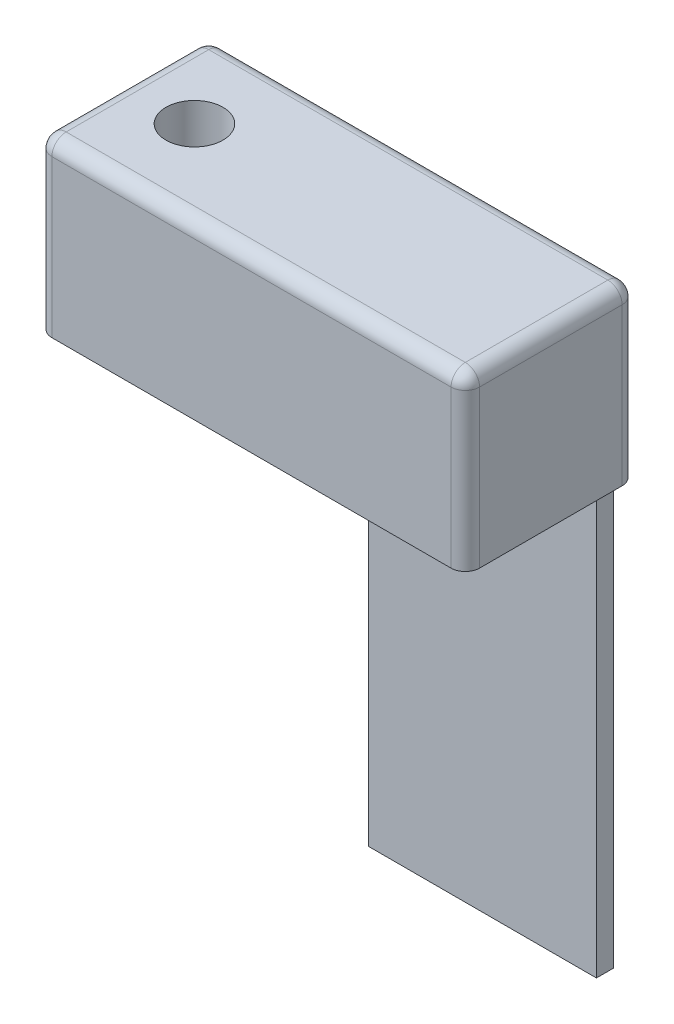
from build123d import *

# Parameters (mm, degrees)
SKETCH1_W           = 381
SKETCH1_H           = 152.4
BOSS_EXTRUDE1_DEPTH = 152.4
SKETCH2_R           = 50.8
CUT_EXTRUDE1_DEPTH  = 76.2
SKETCH3_R           = 25.4
CUT_EXTRUDE2_DEPTH  = 203.2
SKETCH4_W           = 203.2
SKETCH4_H           = 15.24
BOSS_EXTRUDE3_DEPTH = 381
FILLET1_R           = 12.7


with BuildPart() as part:
    # Sketch1 → Boss-Extrude1 (new body)
    with BuildSketch(Plane(origin=(0, 0, 0), x_dir=(1, 0, 0), z_dir=(0, 1, 0))):
        Rectangle(SKETCH1_W, SKETCH1_H)
    extrude(amount=BOSS_EXTRUDE1_DEPTH)

    # Sketch2 → Cut-Extrude1 (cut)
    with BuildSketch(Plane(origin=(0, 0, -76.2), x_dir=(-1, 0, 0), z_dir=(0, 0, -1))):
        with Locations((0, 76.2)):
            Circle(SKETCH2_R)
    extrude(amount=-CUT_EXTRUDE1_DEPTH, mode=Mode.SUBTRACT)

    # Sketch3 → Cut-Extrude2 (cut)
    with BuildSketch(Plane(origin=(0, 152.4, 0), x_dir=(1, 0, 0), z_dir=(0, 1, 0))):
        with Locations(Location((-127, 0, 0), (0, 0, 270))):
            Circle(SKETCH3_R)
    extrude(amount=-CUT_EXTRUDE2_DEPTH, mode=Mode.SUBTRACT)

    # Sketch4 → Boss-Extrude3 (add)
    with BuildSketch(Plane.XZ):
        with Locations((76.2, -60.96)):
            Rectangle(SKETCH4_W, SKETCH4_H)
    extrude(amount=BOSS_EXTRUDE3_DEPTH)

    # Fillet1
    fillet1_edges = [part.edges().sort_by_distance(p)[0] for p in [
        (-190.5, 152.4, 0),
        (0, 152.4, 76.2),
        (190.5, 152.4, 0),
        (190.5, 76.2, 76.2),
        (-190.5, 76.2, 76.2),
        (-190.5, 76.2, -76.2),
        (190.5, 76.2, -76.2),
        (0, 152.4, -76.2),
    ]]
    fillet(fillet1_edges, radius=FILLET1_R)


solid = part.part
